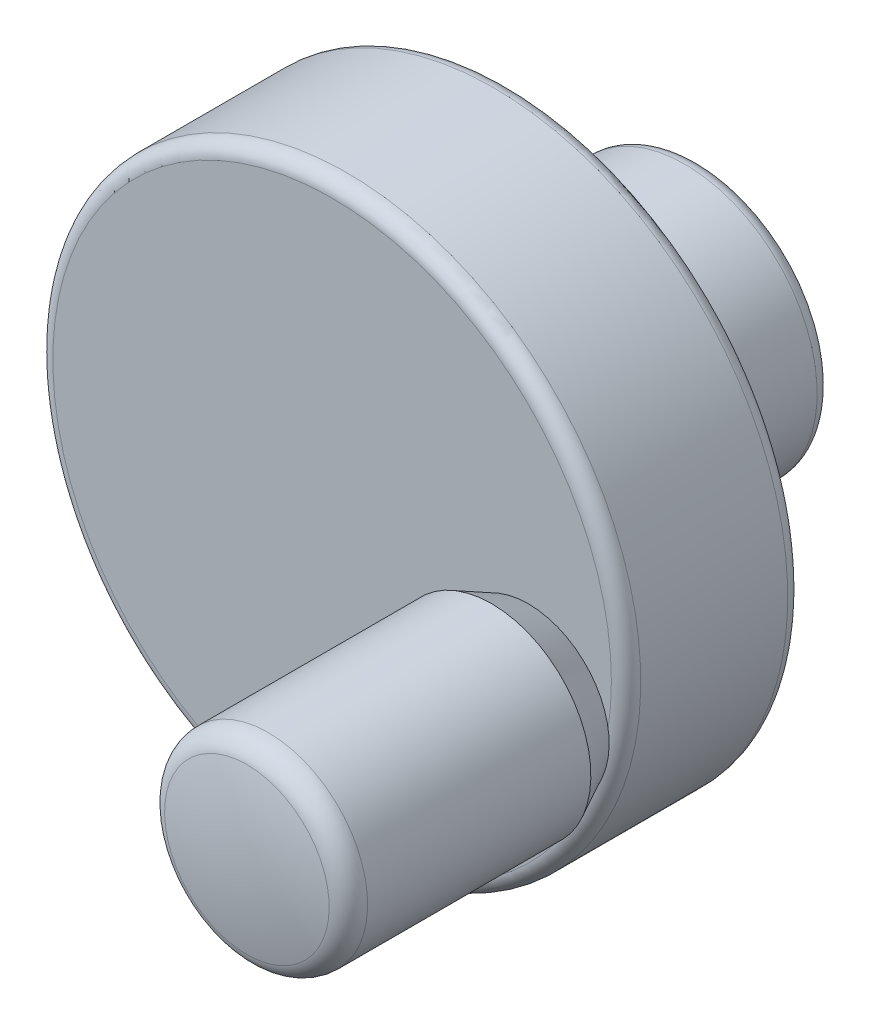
ISO-10303-21;
HEADER;
FILE_DESCRIPTION(('STEP AP214'),'2;1');
FILE_NAME('part.step','',(''),(''),'','','');
FILE_SCHEMA(('AUTOMOTIVE_DESIGN { 1 0 10303 214 1 1 1 1 }'));
ENDSEC;
DATA;
#1=APPLICATION_CONTEXT('core data for automotive mechanical design processes');
#2=APPLICATION_PROTOCOL_DEFINITION('international standard','automotive_design',2000,#1);
#3=PRODUCT_CONTEXT('',#1,'mechanical');
#4=PRODUCT('Part','Part','',(#3));
#5=PRODUCT_RELATED_PRODUCT_CATEGORY('part','',(#4));
#6=PRODUCT_DEFINITION_FORMATION('','',#4);
#7=PRODUCT_DEFINITION_CONTEXT('part definition',#1,'design');
#8=PRODUCT_DEFINITION('design','',#6,#7);
#9=PRODUCT_DEFINITION_SHAPE('','',#8);
#10=(LENGTH_UNIT() NAMED_UNIT(*) SI_UNIT(.MILLI.,.METRE.));
#11=(NAMED_UNIT(*) PLANE_ANGLE_UNIT() SI_UNIT($,.RADIAN.));
#12=(NAMED_UNIT(*) SI_UNIT($,.STERADIAN.) SOLID_ANGLE_UNIT());
#13=UNCERTAINTY_MEASURE_WITH_UNIT(LENGTH_MEASURE(1.E-05),#10,'distance_accuracy_value','');
#14=(GEOMETRIC_REPRESENTATION_CONTEXT(3) GLOBAL_UNCERTAINTY_ASSIGNED_CONTEXT((#13)) GLOBAL_UNIT_ASSIGNED_CONTEXT((#10,
#11,#12)) REPRESENTATION_CONTEXT('',''));
#15=CARTESIAN_POINT('',(0.,0.,0.));
#16=DIRECTION('',(0.,0.,1.));
#17=DIRECTION('',(1.,0.,0.));
#18=AXIS2_PLACEMENT_3D('',#15,#16,#17);
#19=CARTESIAN_POINT('',(0.,0.,24.));
#20=DIRECTION('',(0.,0.,1.));
#21=DIRECTION('',(0.138310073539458,-0.9903889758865,0.));
#22=AXIS2_PLACEMENT_3D('',#19,#20,#21);
#23=TOROIDAL_SURFACE('',#22,19.,1.);
#24=CARTESIAN_POINT('',(0.,0.,24.));
#25=DIRECTION('',(0.,0.,1.));
#26=DIRECTION('',(0.138310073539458,-0.9903889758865,0.));
#27=AXIS2_PLACEMENT_3D('',#24,#25,#26);
#28=CIRCLE('',#27,20.);
#29=CARTESIAN_POINT('',(2.76620147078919,-19.80777951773,24.));
#30=VERTEX_POINT('',#29);
#31=EDGE_CURVE('E8',#30,#30,#28,.T.);
#32=ORIENTED_EDGE('',*,*,#31,.T.);
#33=EDGE_LOOP('',(#32));
#34=FACE_BOUND('',#33,.T.);
#35=CARTESIAN_POINT('',(0.,0.,25.));
#36=DIRECTION('',(0.,0.,1.));
#37=DIRECTION('',(0.138310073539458,-0.9903889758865,0.));
#38=AXIS2_PLACEMENT_3D('',#35,#36,#37);
#39=CIRCLE('',#38,19.);
#40=CARTESIAN_POINT('',(2.62789139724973,-18.8173905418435,25.));
#41=VERTEX_POINT('',#40);
#42=EDGE_CURVE('E43',#41,#41,#39,.T.);
#43=ORIENTED_EDGE('',*,*,#42,.F.);
#44=EDGE_LOOP('',(#43));
#45=FACE_BOUND('',#44,.T.);
#46=ADVANCED_FACE('F12',(#34,#45),#23,.T.);
#47=CARTESIAN_POINT('',(0.,0.,27.5));
#48=DIRECTION('',(0.,0.,1.));
#49=DIRECTION('',(0.138310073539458,-0.9903889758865,0.));
#50=AXIS2_PLACEMENT_3D('',#47,#48,#49);
#51=CYLINDRICAL_SURFACE('',#50,20.);
#52=CARTESIAN_POINT('',(0.,0.,14.));
#53=DIRECTION('',(0.,0.,1.));
#54=DIRECTION('',(0.138310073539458,-0.9903889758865,0.));
#55=AXIS2_PLACEMENT_3D('',#52,#53,#54);
#56=CIRCLE('',#55,20.);
#57=CARTESIAN_POINT('',(2.76620147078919,-19.80777951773,14.));
#58=VERTEX_POINT('',#57);
#59=EDGE_CURVE('E18',#58,#58,#56,.T.);
#60=ORIENTED_EDGE('',*,*,#59,.T.);
#61=EDGE_LOOP('',(#60));
#62=FACE_BOUND('',#61,.T.);
#63=ORIENTED_EDGE('',*,*,#31,.F.);
#64=EDGE_LOOP('',(#63));
#65=FACE_BOUND('',#64,.T.);
#66=ADVANCED_FACE('F89',(#62,#65),#51,.T.);
#67=CARTESIAN_POINT('',(0.,0.,14.));
#68=DIRECTION('',(0.,0.,1.));
#69=DIRECTION('',(0.138310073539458,-0.9903889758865,0.));
#70=AXIS2_PLACEMENT_3D('',#67,#68,#69);
#71=TOROIDAL_SURFACE('',#70,19.,1.);
#72=CARTESIAN_POINT('',(0.,0.,13.));
#73=DIRECTION('',(0.,0.,1.));
#74=DIRECTION('',(0.138310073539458,-0.9903889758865,0.));
#75=AXIS2_PLACEMENT_3D('',#72,#73,#74);
#76=CIRCLE('',#75,19.);
#77=CARTESIAN_POINT('',(2.62789139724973,-18.8173905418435,13.));
#78=VERTEX_POINT('',#77);
#79=EDGE_CURVE('E22',#78,#78,#76,.T.);
#80=ORIENTED_EDGE('',*,*,#79,.T.);
#81=EDGE_LOOP('',(#80));
#82=FACE_BOUND('',#81,.T.);
#83=ORIENTED_EDGE('',*,*,#59,.F.);
#84=EDGE_LOOP('',(#83));
#85=FACE_BOUND('',#84,.T.);
#86=ADVANCED_FACE('F93',(#82,#85),#71,.T.);
#87=CARTESIAN_POINT('',(-18.8173905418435,-2.62789139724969,13.));
#88=DIRECTION('',(0.,0.,-1.));
#89=DIRECTION('',(-0.138310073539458,0.9903889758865,0.));
#90=AXIS2_PLACEMENT_3D('',#87,#88,#89);
#91=PLANE('',#90);
#92=CARTESIAN_POINT('',(0.,0.,13.));
#93=DIRECTION('',(0.,0.,1.));
#94=DIRECTION('',(0.138310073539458,-0.9903889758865,0.));
#95=AXIS2_PLACEMENT_3D('',#92,#93,#94);
#96=CIRCLE('',#95,10.);
#97=CARTESIAN_POINT('',(1.38310073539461,-9.90388975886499,13.));
#98=VERTEX_POINT('',#97);
#99=EDGE_CURVE('E26',#98,#98,#96,.T.);
#100=ORIENTED_EDGE('',*,*,#99,.T.);
#101=EDGE_LOOP('',(#100));
#102=FACE_BOUND('',#101,.T.);
#103=ORIENTED_EDGE('',*,*,#79,.F.);
#104=EDGE_LOOP('',(#103));
#105=FACE_BOUND('',#104,.T.);
#106=ADVANCED_FACE('F100',(#102,#105),#91,.T.);
#107=CARTESIAN_POINT('',(0.,0.,12.));
#108=DIRECTION('',(0.,0.,1.));
#109=DIRECTION('',(0.138310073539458,-0.9903889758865,0.));
#110=AXIS2_PLACEMENT_3D('',#107,#108,#109);
#111=TOROIDAL_SURFACE('',#110,10.,1.);
#112=ORIENTED_EDGE('',*,*,#99,.F.);
#113=EDGE_LOOP('',(#112));
#114=FACE_BOUND('',#113,.T.);
#115=CARTESIAN_POINT('',(0.,0.,12.));
#116=DIRECTION('',(0.,0.,1.));
#117=DIRECTION('',(0.138310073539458,-0.9903889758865,0.));
#118=AXIS2_PLACEMENT_3D('',#115,#116,#117);
#119=CIRCLE('',#118,9.);
#120=CARTESIAN_POINT('',(1.24479066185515,-8.91350078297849,12.));
#121=VERTEX_POINT('',#120);
#122=EDGE_CURVE('E31',#121,#121,#119,.T.);
#123=ORIENTED_EDGE('',*,*,#122,.T.);
#124=EDGE_LOOP('',(#123));
#125=FACE_BOUND('',#124,.T.);
#126=ADVANCED_FACE('F107',(#114,#125),#111,.F.);
#127=CARTESIAN_POINT('',(0.,0.,27.5));
#128=DIRECTION('',(0.,0.,1.));
#129=DIRECTION('',(0.138310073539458,-0.9903889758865,0.));
#130=AXIS2_PLACEMENT_3D('',#127,#128,#129);
#131=CYLINDRICAL_SURFACE('',#130,9.);
#132=ORIENTED_EDGE('',*,*,#122,.F.);
#133=EDGE_LOOP('',(#132));
#134=FACE_BOUND('',#133,.T.);
#135=CARTESIAN_POINT('',(0.,0.,1.));
#136=DIRECTION('',(0.,0.,1.));
#137=DIRECTION('',(0.138310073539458,-0.9903889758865,0.));
#138=AXIS2_PLACEMENT_3D('',#135,#136,#137);
#139=CIRCLE('',#138,9.);
#140=CARTESIAN_POINT('',(1.24479066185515,-8.91350078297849,0.999999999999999));
#141=VERTEX_POINT('',#140);
#142=EDGE_CURVE('E34',#141,#141,#139,.T.);
#143=ORIENTED_EDGE('',*,*,#142,.T.);
#144=EDGE_LOOP('',(#143));
#145=FACE_BOUND('',#144,.T.);
#146=ADVANCED_FACE('F111',(#134,#145),#131,.T.);
#147=CARTESIAN_POINT('',(0.,0.,1.));
#148=DIRECTION('',(0.,0.,1.));
#149=DIRECTION('',(0.138310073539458,-0.9903889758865,0.));
#150=AXIS2_PLACEMENT_3D('',#147,#148,#149);
#151=TOROIDAL_SURFACE('',#150,8.,1.);
#152=CARTESIAN_POINT('',(0.,0.,0.));
#153=DIRECTION('',(0.,0.,1.));
#154=DIRECTION('',(0.138310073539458,-0.9903889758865,0.));
#155=AXIS2_PLACEMENT_3D('',#152,#153,#154);
#156=CIRCLE('',#155,8.);
#157=CARTESIAN_POINT('',(1.1064805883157,-7.92311180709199,0.));
#158=VERTEX_POINT('',#157);
#159=EDGE_CURVE('E37',#158,#158,#156,.T.);
#160=ORIENTED_EDGE('',*,*,#159,.T.);
#161=EDGE_LOOP('',(#160));
#162=FACE_BOUND('',#161,.T.);
#163=ORIENTED_EDGE('',*,*,#142,.F.);
#164=EDGE_LOOP('',(#163));
#165=FACE_BOUND('',#164,.T.);
#166=ADVANCED_FACE('F84',(#162,#165),#151,.T.);
#167=CARTESIAN_POINT('',(-7.92311180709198,-1.10648058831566,0.));
#168=DIRECTION('',(0.,0.,-1.));
#169=DIRECTION('',(-0.138310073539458,0.9903889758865,0.));
#170=AXIS2_PLACEMENT_3D('',#167,#168,#169);
#171=PLANE('',#170);
#172=CARTESIAN_POINT('',(0.,0.,0.));
#173=DIRECTION('',(0.,0.,1.));
#174=DIRECTION('',(0.138310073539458,-0.9903889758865,0.));
#175=AXIS2_PLACEMENT_3D('',#172,#173,#174);
#176=CIRCLE('',#175,2.5);
#177=CARTESIAN_POINT('',(0.345775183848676,-2.47597243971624,0.));
#178=VERTEX_POINT('',#177);
#179=EDGE_CURVE('E40',#178,#178,#176,.T.);
#180=ORIENTED_EDGE('',*,*,#179,.T.);
#181=EDGE_LOOP('',(#180));
#182=FACE_BOUND('',#181,.T.);
#183=ORIENTED_EDGE('',*,*,#159,.F.);
#184=EDGE_LOOP('',(#183));
#185=FACE_BOUND('',#184,.T.);
#186=ADVANCED_FACE('F73',(#182,#185),#171,.T.);
#187=CARTESIAN_POINT('',(0.,0.,27.5));
#188=DIRECTION('',(0.,0.,1.));
#189=DIRECTION('',(0.138310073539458,-0.9903889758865,0.));
#190=AXIS2_PLACEMENT_3D('',#187,#188,#189);
#191=CYLINDRICAL_SURFACE('',#190,2.5);
#192=ORIENTED_EDGE('',*,*,#179,.F.);
#193=EDGE_LOOP('',(#192));
#194=FACE_BOUND('',#193,.T.);
#195=CARTESIAN_POINT('',(0.,0.,10.));
#196=DIRECTION('',(0.,0.,-1.));
#197=DIRECTION('',(0.251606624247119,0.967829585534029,0.));
#198=AXIS2_PLACEMENT_3D('',#195,#196,#197);
#199=CIRCLE('',#198,2.5);
#200=CARTESIAN_POINT('',(0.629016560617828,2.41957396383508,10.));
#201=VERTEX_POINT('',#200);
#202=EDGE_CURVE('E64',#201,#201,#199,.T.);
#203=ORIENTED_EDGE('',*,*,#202,.F.);
#204=EDGE_LOOP('',(#203));
#205=FACE_BOUND('',#204,.T.);
#206=ADVANCED_FACE('F70',(#194,#205),#191,.F.);
#207=CARTESIAN_POINT('',(-18.8173905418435,-2.62789139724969,25.));
#208=DIRECTION('',(0.,0.,-1.));
#209=DIRECTION('',(-0.138310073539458,0.9903889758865,0.));
#210=AXIS2_PLACEMENT_3D('',#207,#208,#209);
#211=PLANE('',#210);
#212=CARTESIAN_POINT('',(13.5496141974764,-3.5224927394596,25.));
#213=DIRECTION('',(0.,0.,-1.));
#214=DIRECTION('',(0.,1.,0.));
#215=AXIS2_PLACEMENT_3D('',#212,#213,#214);
#216=CIRCLE('',#215,3.99999999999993);
#217=CARTESIAN_POINT('',(13.5496141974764,0.477507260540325,25.));
#218=VERTEX_POINT('',#217);
#219=EDGE_CURVE('E61',#218,#218,#216,.T.);
#220=ORIENTED_EDGE('',*,*,#219,.T.);
#221=EDGE_LOOP('',(#220));
#222=FACE_BOUND('',#221,.T.);
#223=ORIENTED_EDGE('',*,*,#42,.T.);
#224=EDGE_LOOP('',(#223));
#225=FACE_BOUND('',#224,.T.);
#226=ADVANCED_FACE('F72',(#222,#225),#211,.F.);
#227=CARTESIAN_POINT('',(13.5496141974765,-3.5224927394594,20.6000000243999));
#228=DIRECTION('',(1.,0.,0.));
#229=DIRECTION('',(0.,0.,1.));
#230=AXIS2_PLACEMENT_3D('',#227,#228,#229);
#231=SPHERICAL_SURFACE('',#230,24.3999999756);
#232=CARTESIAN_POINT('',(13.5496141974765,-3.5224927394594,20.6000000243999));
#233=DIRECTION('',(0.,0.,-1.));
#234=DIRECTION('',(0.,1.,0.));
#235=AXIS2_PLACEMENT_3D('',#232,#233,#234);
#236=SPHERICAL_SURFACE('',#235,24.3999999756);
#237=CARTESIAN_POINT('',(13.5496141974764,-3.52249273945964,44.3491215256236));
#238=DIRECTION('',(0.,0.,-1.));
#239=DIRECTION('',(0.,1.,0.));
#240=AXIS2_PLACEMENT_3D('',#237,#238,#239);
#241=CIRCLE('',#240,5.59814493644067);
#242=CARTESIAN_POINT('',(13.5496141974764,2.07565219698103,44.3491215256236));
#243=VERTEX_POINT('',#242);
#244=EDGE_CURVE('E46',#243,#243,#241,.T.);
#245=ORIENTED_EDGE('',*,*,#244,.F.);
#246=EDGE_LOOP('',(#245));
#247=FACE_BOUND('',#246,.T.);
#248=ADVANCED_FACE('F81',(#247),#236,.T.);
#249=CARTESIAN_POINT('',(13.5496141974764,-3.52249273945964,42.8891345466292));
#250=DIRECTION('',(0.,0.,-1.));
#251=DIRECTION('',(0.,1.,0.));
#252=AXIS2_PLACEMENT_3D('',#249,#250,#251);
#253=TOROIDAL_SURFACE('',#252,5.25399668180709,1.50000000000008);
#254=CARTESIAN_POINT('',(13.5496141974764,-3.52249273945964,42.8891345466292));
#255=DIRECTION('',(0.,0.,-1.));
#256=DIRECTION('',(0.,1.,0.));
#257=AXIS2_PLACEMENT_3D('',#254,#255,#256);
#258=CIRCLE('',#257,6.75399668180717);
#259=CARTESIAN_POINT('',(13.5496141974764,3.23150394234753,42.8891345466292));
#260=VERTEX_POINT('',#259);
#261=EDGE_CURVE('E49',#260,#260,#258,.T.);
#262=ORIENTED_EDGE('',*,*,#261,.F.);
#263=EDGE_LOOP('',(#262));
#264=FACE_BOUND('',#263,.T.);
#265=ORIENTED_EDGE('',*,*,#244,.T.);
#266=EDGE_LOOP('',(#265));
#267=FACE_BOUND('',#266,.T.);
#268=ADVANCED_FACE('F155',(#264,#267),#253,.T.);
#269=CARTESIAN_POINT('',(13.5496141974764,-3.52249273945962,13.9654943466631));
#270=DIRECTION('',(0.,0.,-1.));
#271=DIRECTION('',(0.,1.,0.));
#272=AXIS2_PLACEMENT_3D('',#269,#270,#271);
#273=CYLINDRICAL_SURFACE('',#272,6.75399668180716);
#274=CARTESIAN_POINT('',(13.5496141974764,-3.52249273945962,27.700000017));
#275=DIRECTION('',(0.,0.,-1.));
#276=DIRECTION('',(0.,1.,0.));
#277=AXIS2_PLACEMENT_3D('',#274,#275,#276);
#278=CIRCLE('',#277,6.75399668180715);
#279=CARTESIAN_POINT('',(13.5496141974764,3.23150394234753,27.700000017));
#280=VERTEX_POINT('',#279);
#281=EDGE_CURVE('E52',#280,#280,#278,.T.);
#282=ORIENTED_EDGE('',*,*,#281,.F.);
#283=EDGE_LOOP('',(#282));
#284=FACE_BOUND('',#283,.T.);
#285=ORIENTED_EDGE('',*,*,#261,.T.);
#286=EDGE_LOOP('',(#285));
#287=FACE_BOUND('',#286,.T.);
#288=ADVANCED_FACE('F165',(#284,#287),#273,.T.);
#289=CARTESIAN_POINT('',(13.5496141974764,-3.5224927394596,25.2));
#290=DIRECTION('',(0.,0.,1.));
#291=DIRECTION('',(0.,-1.,0.));
#292=AXIS2_PLACEMENT_3D('',#289,#290,#291);
#293=CONICAL_SURFACE('',#292,5.49515095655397,0.466474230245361);
#294=ORIENTED_EDGE('',*,*,#281,.T.);
#295=EDGE_LOOP('',(#294));
#296=FACE_BOUND('',#295,.T.);
#297=CARTESIAN_POINT('',(13.5496141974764,-3.5224927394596,25.2));
#298=DIRECTION('',(0.,0.,-1.));
#299=DIRECTION('',(0.,1.,0.));
#300=AXIS2_PLACEMENT_3D('',#297,#298,#299);
#301=CIRCLE('',#300,5.49515095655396);
#302=CARTESIAN_POINT('',(13.5496141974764,1.97265821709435,25.2));
#303=VERTEX_POINT('',#302);
#304=EDGE_CURVE('E55',#303,#303,#301,.T.);
#305=ORIENTED_EDGE('',*,*,#304,.F.);
#306=EDGE_LOOP('',(#305));
#307=FACE_BOUND('',#306,.T.);
#308=ADVANCED_FACE('F175',(#296,#307),#293,.T.);
#309=CARTESIAN_POINT('',(13.5496141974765,-9.01764369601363,25.2));
#310=DIRECTION('',(0.,0.,1.));
#311=DIRECTION('',(0.,-1.,0.));
#312=AXIS2_PLACEMENT_3D('',#309,#310,#311);
#313=PLANE('',#312);
#314=CARTESIAN_POINT('',(13.5496141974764,-3.5224927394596,25.2));
#315=DIRECTION('',(0.,0.,-1.));
#316=DIRECTION('',(0.,1.,0.));
#317=AXIS2_PLACEMENT_3D('',#314,#315,#316);
#318=CIRCLE('',#317,3.99999999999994);
#319=CARTESIAN_POINT('',(13.5496141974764,0.47750726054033,25.2));
#320=VERTEX_POINT('',#319);
#321=EDGE_CURVE('E58',#320,#320,#318,.T.);
#322=ORIENTED_EDGE('',*,*,#321,.F.);
#323=EDGE_LOOP('',(#322));
#324=FACE_BOUND('',#323,.T.);
#325=ORIENTED_EDGE('',*,*,#304,.T.);
#326=EDGE_LOOP('',(#325));
#327=FACE_BOUND('',#326,.T.);
#328=ADVANCED_FACE('F185',(#324,#327),#313,.F.);
#329=CARTESIAN_POINT('',(13.5496141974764,-3.52249273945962,13.9654943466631));
#330=DIRECTION('',(0.,0.,-1.));
#331=DIRECTION('',(0.,1.,0.));
#332=AXIS2_PLACEMENT_3D('',#329,#330,#331);
#333=CYLINDRICAL_SURFACE('',#332,3.99999999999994);
#334=ORIENTED_EDGE('',*,*,#321,.T.);
#335=EDGE_LOOP('',(#334));
#336=FACE_BOUND('',#335,.T.);
#337=ORIENTED_EDGE('',*,*,#219,.F.);
#338=EDGE_LOOP('',(#337));
#339=FACE_BOUND('',#338,.T.);
#340=ADVANCED_FACE('F195',(#336,#339),#333,.T.);
#341=CARTESIAN_POINT('',(0.,0.,10.));
#342=DIRECTION('',(0.,0.,-1.));
#343=DIRECTION('',(0.251606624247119,0.967829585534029,0.));
#344=AXIS2_PLACEMENT_3D('',#341,#342,#343);
#345=PLANE('',#344);
#346=ORIENTED_EDGE('',*,*,#202,.T.);
#347=EDGE_LOOP('',(#346));
#348=FACE_BOUND('',#347,.T.);
#349=ADVANCED_FACE('F68',(#348),#345,.T.);
#350=CLOSED_SHELL('',(#46,#66,#86,#106,#126,#146,#166,#186,#206,#226,#248,#268,#288,#308,#328,
#340,#349));
#351=MANIFOLD_SOLID_BREP('B1',#350);
#352=ADVANCED_BREP_SHAPE_REPRESENTATION('',(#18,#351),#14);
#353=SHAPE_DEFINITION_REPRESENTATION(#9,#352);
ENDSEC;
END-ISO-10303-21;
